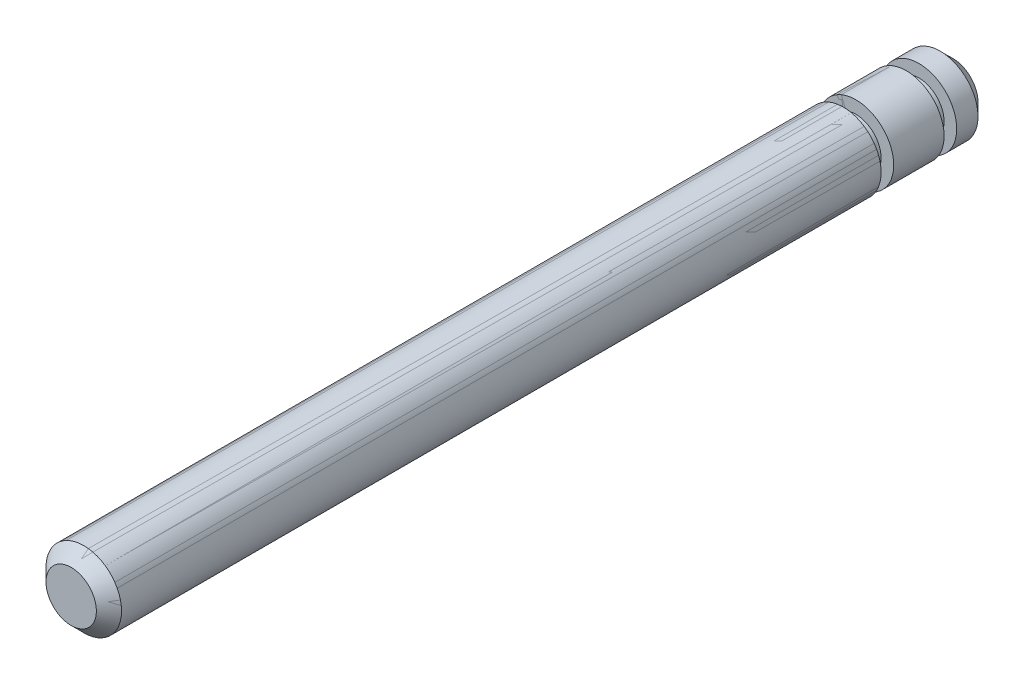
ISO-10303-21;
HEADER;
FILE_DESCRIPTION(('STEP AP214'),'2;1');
FILE_NAME('part.step','',(''),(''),'','','');
FILE_SCHEMA(('AUTOMOTIVE_DESIGN { 1 0 10303 214 1 1 1 1 }'));
ENDSEC;
DATA;
#1=APPLICATION_CONTEXT('core data for automotive mechanical design processes');
#2=APPLICATION_PROTOCOL_DEFINITION('international standard','automotive_design',2000,#1);
#3=PRODUCT_CONTEXT('',#1,'mechanical');
#4=PRODUCT('Part','Part','',(#3));
#5=PRODUCT_RELATED_PRODUCT_CATEGORY('part','',(#4));
#6=PRODUCT_DEFINITION_FORMATION('','',#4);
#7=PRODUCT_DEFINITION_CONTEXT('part definition',#1,'design');
#8=PRODUCT_DEFINITION('design','',#6,#7);
#9=PRODUCT_DEFINITION_SHAPE('','',#8);
#10=(LENGTH_UNIT() NAMED_UNIT(*) SI_UNIT(.MILLI.,.METRE.));
#11=(NAMED_UNIT(*) PLANE_ANGLE_UNIT() SI_UNIT($,.RADIAN.));
#12=(NAMED_UNIT(*) SI_UNIT($,.STERADIAN.) SOLID_ANGLE_UNIT());
#13=UNCERTAINTY_MEASURE_WITH_UNIT(LENGTH_MEASURE(1.E-05),#10,'distance_accuracy_value','');
#14=(GEOMETRIC_REPRESENTATION_CONTEXT(3) GLOBAL_UNCERTAINTY_ASSIGNED_CONTEXT((#13)) GLOBAL_UNIT_ASSIGNED_CONTEXT((#10,
#11,#12)) REPRESENTATION_CONTEXT('',''));
#15=CARTESIAN_POINT('',(0.,0.,0.));
#16=DIRECTION('',(0.,0.,1.));
#17=DIRECTION('',(1.,0.,0.));
#18=AXIS2_PLACEMENT_3D('',#15,#16,#17);
#19=CARTESIAN_POINT('',(1.,-1.,-35.));
#20=DIRECTION('',(0.,0.,-1.));
#21=DIRECTION('',(-1.,0.,0.));
#22=AXIS2_PLACEMENT_3D('',#19,#20,#21);
#23=PLANE('',#22);
#24=CARTESIAN_POINT('',(0.,0.,-35.));
#25=DIRECTION('',(0.,0.,1.));
#26=DIRECTION('',(1.,0.,0.));
#27=AXIS2_PLACEMENT_3D('',#24,#25,#26);
#28=CIRCLE('',#27,1.);
#29=CARTESIAN_POINT('',(1.,0.,-35.));
#30=VERTEX_POINT('',#29);
#31=EDGE_CURVE('P0_E405',#30,#30,#28,.F.);
#32=ORIENTED_EDGE('',*,*,#31,.T.);
#33=EDGE_LOOP('',(#32));
#34=FACE_BOUND('',#33,.T.);
#35=ADVANCED_FACE('P0_F348',(#34),#23,.T.);
#36=CARTESIAN_POINT('',(0.,0.,-35.));
#37=DIRECTION('',(0.,0.,1.));
#38=DIRECTION('',(1.,0.,0.));
#39=AXIS2_PLACEMENT_3D('',#36,#37,#38);
#40=CONICAL_SURFACE('',#39,1.,0.785398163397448);
#41=ORIENTED_EDGE('',*,*,#31,.F.);
#42=EDGE_LOOP('',(#41));
#43=FACE_BOUND('',#42,.T.);
#44=CARTESIAN_POINT('',(0.,0.,-34.5));
#45=DIRECTION('',(0.,0.,1.));
#46=DIRECTION('',(0.,-1.,0.));
#47=AXIS2_PLACEMENT_3D('',#44,#45,#46);
#48=CIRCLE('',#47,1.5);
#49=CARTESIAN_POINT('',(0.,-1.5,-34.5));
#50=VERTEX_POINT('',#49);
#51=EDGE_CURVE('P0_E403',#50,#50,#48,.F.);
#52=ORIENTED_EDGE('',*,*,#51,.T.);
#53=EDGE_LOOP('',(#52));
#54=FACE_BOUND('',#53,.T.);
#55=ADVANCED_FACE('P0_F415',(#43,#54),#40,.T.);
#56=CARTESIAN_POINT('',(0.,0.,-34.5));
#57=DIRECTION('',(0.,0.,1.));
#58=DIRECTION('',(1.,0.,0.));
#59=AXIS2_PLACEMENT_3D('',#56,#57,#58);
#60=CYLINDRICAL_SURFACE('',#59,1.5);
#61=ORIENTED_EDGE('',*,*,#51,.F.);
#62=EDGE_LOOP('',(#61));
#63=FACE_BOUND('',#62,.T.);
#64=CARTESIAN_POINT('',(0.,0.,-33.6540605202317));
#65=DIRECTION('',(0.,0.,1.));
#66=DIRECTION('',(1.,0.,0.));
#67=AXIS2_PLACEMENT_3D('',#64,#65,#66);
#68=CIRCLE('',#67,1.5);
#69=CARTESIAN_POINT('',(1.5,0.,-33.6540605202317));
#70=VERTEX_POINT('',#69);
#71=EDGE_CURVE('P0_E398',#70,#70,#68,.F.);
#72=ORIENTED_EDGE('',*,*,#71,.T.);
#73=EDGE_LOOP('',(#72));
#74=FACE_BOUND('',#73,.T.);
#75=ADVANCED_FACE('P0_F417',(#63,#74),#60,.T.);
#76=CARTESIAN_POINT('',(0.463525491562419,-2.92658477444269,-33.654060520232));
#77=DIRECTION('',(0.,0.,-1.));
#78=DIRECTION('',(-0.809016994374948,0.587785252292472,0.));
#79=AXIS2_PLACEMENT_3D('',#76,#77,#78);
#80=PLANE('',#79);
#81=CARTESIAN_POINT('',(0.,0.,-33.654060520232));
#82=DIRECTION('',(0.,0.,1.));
#83=DIRECTION('',(1.,0.,0.));
#84=AXIS2_PLACEMENT_3D('',#81,#82,#83);
#85=CIRCLE('',#84,1.);
#86=CARTESIAN_POINT('',(1.,0.,-33.654060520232));
#87=VERTEX_POINT('',#86);
#88=EDGE_CURVE('P0_E393',#87,#87,#85,.F.);
#89=ORIENTED_EDGE('',*,*,#88,.T.);
#90=EDGE_LOOP('',(#89));
#91=FACE_BOUND('',#90,.T.);
#92=ORIENTED_EDGE('',*,*,#71,.F.);
#93=EDGE_LOOP('',(#92));
#94=FACE_BOUND('',#93,.T.);
#95=ADVANCED_FACE('P0_F420',(#91,#94),#80,.F.);
#96=CARTESIAN_POINT('',(0.,0.,-33.654060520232));
#97=DIRECTION('',(0.,0.,1.));
#98=DIRECTION('',(1.,0.,0.));
#99=AXIS2_PLACEMENT_3D('',#96,#97,#98);
#100=CYLINDRICAL_SURFACE('',#99,1.);
#101=ORIENTED_EDGE('',*,*,#88,.F.);
#102=EDGE_LOOP('',(#101));
#103=FACE_BOUND('',#102,.T.);
#104=CARTESIAN_POINT('',(0.,0.,-33.154060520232));
#105=DIRECTION('',(0.,0.,1.));
#106=DIRECTION('',(1.,0.,0.));
#107=AXIS2_PLACEMENT_3D('',#104,#105,#106);
#108=CIRCLE('',#107,1.);
#109=CARTESIAN_POINT('',(1.,0.,-33.154060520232));
#110=VERTEX_POINT('',#109);
#111=EDGE_CURVE('P0_E388',#110,#110,#108,.F.);
#112=ORIENTED_EDGE('',*,*,#111,.T.);
#113=EDGE_LOOP('',(#112));
#114=FACE_BOUND('',#113,.T.);
#115=ADVANCED_FACE('P0_F425',(#103,#114),#100,.T.);
#116=CARTESIAN_POINT('',(2.92658477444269,0.463525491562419,-33.154060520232));
#117=DIRECTION('',(0.,0.,1.));
#118=DIRECTION('',(-0.809016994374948,0.587785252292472,0.));
#119=AXIS2_PLACEMENT_3D('',#116,#117,#118);
#120=PLANE('',#119);
#121=ORIENTED_EDGE('',*,*,#111,.F.);
#122=EDGE_LOOP('',(#121));
#123=FACE_BOUND('',#122,.T.);
#124=CARTESIAN_POINT('',(0.,0.,-33.1540605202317));
#125=DIRECTION('',(0.,0.,1.));
#126=DIRECTION('',(1.,0.,0.));
#127=AXIS2_PLACEMENT_3D('',#124,#125,#126);
#128=CIRCLE('',#127,1.5);
#129=CARTESIAN_POINT('',(1.5,0.,-33.1540605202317));
#130=VERTEX_POINT('',#129);
#131=EDGE_CURVE('P0_E383',#130,#130,#128,.F.);
#132=ORIENTED_EDGE('',*,*,#131,.T.);
#133=EDGE_LOOP('',(#132));
#134=FACE_BOUND('',#133,.T.);
#135=ADVANCED_FACE('P0_F431',(#123,#134),#120,.F.);
#136=CARTESIAN_POINT('',(0.,0.,-33.1540605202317));
#137=DIRECTION('',(0.,0.,1.));
#138=DIRECTION('',(1.,0.,0.));
#139=AXIS2_PLACEMENT_3D('',#136,#137,#138);
#140=CYLINDRICAL_SURFACE('',#139,1.5);
#141=ORIENTED_EDGE('',*,*,#131,.F.);
#142=EDGE_LOOP('',(#141));
#143=FACE_BOUND('',#142,.T.);
#144=CARTESIAN_POINT('',(0.,0.,-31.1540605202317));
#145=DIRECTION('',(0.,0.,1.));
#146=DIRECTION('',(1.,0.,0.));
#147=AXIS2_PLACEMENT_3D('',#144,#145,#146);
#148=CIRCLE('',#147,1.5);
#149=CARTESIAN_POINT('',(1.5,0.,-31.1540605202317));
#150=VERTEX_POINT('',#149);
#151=EDGE_CURVE('P0_E378',#150,#150,#148,.F.);
#152=ORIENTED_EDGE('',*,*,#151,.T.);
#153=EDGE_LOOP('',(#152));
#154=FACE_BOUND('',#153,.T.);
#155=ADVANCED_FACE('P0_F462',(#143,#154),#140,.T.);
#156=CARTESIAN_POINT('',(0.463525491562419,-2.92658477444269,-31.154060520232));
#157=DIRECTION('',(0.,0.,-1.));
#158=DIRECTION('',(-0.809016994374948,0.587785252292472,0.));
#159=AXIS2_PLACEMENT_3D('',#156,#157,#158);
#160=PLANE('',#159);
#161=CARTESIAN_POINT('',(0.,0.,-31.154060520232));
#162=DIRECTION('',(0.,0.,1.));
#163=DIRECTION('',(1.,0.,0.));
#164=AXIS2_PLACEMENT_3D('',#161,#162,#163);
#165=CIRCLE('',#164,1.);
#166=CARTESIAN_POINT('',(1.,0.,-31.154060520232));
#167=VERTEX_POINT('',#166);
#168=EDGE_CURVE('P0_E373',#167,#167,#165,.F.);
#169=ORIENTED_EDGE('',*,*,#168,.T.);
#170=EDGE_LOOP('',(#169));
#171=FACE_BOUND('',#170,.T.);
#172=ORIENTED_EDGE('',*,*,#151,.F.);
#173=EDGE_LOOP('',(#172));
#174=FACE_BOUND('',#173,.T.);
#175=ADVANCED_FACE('P0_F464',(#171,#174),#160,.F.);
#176=CARTESIAN_POINT('',(0.,0.,-31.154060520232));
#177=DIRECTION('',(0.,0.,1.));
#178=DIRECTION('',(1.,0.,0.));
#179=AXIS2_PLACEMENT_3D('',#176,#177,#178);
#180=CYLINDRICAL_SURFACE('',#179,1.);
#181=ORIENTED_EDGE('',*,*,#168,.F.);
#182=EDGE_LOOP('',(#181));
#183=FACE_BOUND('',#182,.T.);
#184=CARTESIAN_POINT('',(0.,0.,-30.654060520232));
#185=DIRECTION('',(0.,0.,1.));
#186=DIRECTION('',(1.,0.,0.));
#187=AXIS2_PLACEMENT_3D('',#184,#185,#186);
#188=CIRCLE('',#187,1.);
#189=CARTESIAN_POINT('',(1.,0.,-30.654060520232));
#190=VERTEX_POINT('',#189);
#191=EDGE_CURVE('P0_E368',#190,#190,#188,.F.);
#192=ORIENTED_EDGE('',*,*,#191,.T.);
#193=EDGE_LOOP('',(#192));
#194=FACE_BOUND('',#193,.T.);
#195=ADVANCED_FACE('P0_F466',(#183,#194),#180,.T.);
#196=CARTESIAN_POINT('',(2.92658477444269,0.463525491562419,-30.654060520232));
#197=DIRECTION('',(0.,0.,1.));
#198=DIRECTION('',(-0.809016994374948,0.587785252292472,0.));
#199=AXIS2_PLACEMENT_3D('',#196,#197,#198);
#200=PLANE('',#199);
#201=ORIENTED_EDGE('',*,*,#191,.F.);
#202=EDGE_LOOP('',(#201));
#203=FACE_BOUND('',#202,.T.);
#204=CARTESIAN_POINT('',(0.,0.,-30.6540605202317));
#205=DIRECTION('',(0.,0.,1.));
#206=DIRECTION('',(1.,0.,0.));
#207=AXIS2_PLACEMENT_3D('',#204,#205,#206);
#208=CIRCLE('',#207,1.5);
#209=CARTESIAN_POINT('',(1.5,0.,-30.6540605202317));
#210=VERTEX_POINT('',#209);
#211=EDGE_CURVE('P0_E361',#210,#210,#208,.F.);
#212=ORIENTED_EDGE('',*,*,#211,.T.);
#213=EDGE_LOOP('',(#212));
#214=FACE_BOUND('',#213,.T.);
#215=ADVANCED_FACE('P0_F447',(#203,#214),#200,.F.);
#216=CARTESIAN_POINT('',(0.,0.,-30.6540605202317));
#217=DIRECTION('',(0.,0.,1.));
#218=DIRECTION('',(1.,0.,0.));
#219=AXIS2_PLACEMENT_3D('',#216,#217,#218);
#220=CYLINDRICAL_SURFACE('',#219,1.5);
#221=ORIENTED_EDGE('',*,*,#211,.F.);
#222=EDGE_LOOP('',(#221));
#223=FACE_BOUND('',#222,.T.);
#224=CARTESIAN_POINT('',(0.,0.,-0.5));
#225=DIRECTION('',(0.,0.,1.));
#226=DIRECTION('',(0.,-1.,0.));
#227=AXIS2_PLACEMENT_3D('',#224,#225,#226);
#228=CIRCLE('',#227,1.5);
#229=CARTESIAN_POINT('',(0.,-1.5,-0.5));
#230=VERTEX_POINT('',#229);
#231=EDGE_CURVE('P0_E356',#230,#230,#228,.F.);
#232=ORIENTED_EDGE('',*,*,#231,.T.);
#233=EDGE_LOOP('',(#232));
#234=FACE_BOUND('',#233,.T.);
#235=ADVANCED_FACE('P0_F441',(#223,#234),#220,.T.);
#236=CARTESIAN_POINT('',(0.,0.,-0.5));
#237=DIRECTION('',(0.,0.,-1.));
#238=DIRECTION('',(-1.,0.,0.));
#239=AXIS2_PLACEMENT_3D('',#236,#237,#238);
#240=CONICAL_SURFACE('',#239,1.5,0.785398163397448);
#241=ORIENTED_EDGE('',*,*,#231,.F.);
#242=EDGE_LOOP('',(#241));
#243=FACE_BOUND('',#242,.T.);
#244=CARTESIAN_POINT('',(0.,0.,0.));
#245=DIRECTION('',(0.,0.,-1.));
#246=DIRECTION('',(-1.,0.,0.));
#247=AXIS2_PLACEMENT_3D('',#244,#245,#246);
#248=CIRCLE('',#247,1.);
#249=CARTESIAN_POINT('',(-1.,0.,0.));
#250=VERTEX_POINT('',#249);
#251=EDGE_CURVE('P0_E10',#250,#250,#248,.F.);
#252=ORIENTED_EDGE('',*,*,#251,.F.);
#253=EDGE_LOOP('',(#252));
#254=FACE_BOUND('',#253,.T.);
#255=ADVANCED_FACE('P0_F437',(#243,#254),#240,.T.);
#256=CARTESIAN_POINT('',(-1.63185168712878,-1.,0.));
#257=DIRECTION('',(0.,0.,1.));
#258=DIRECTION('',(1.,0.,0.));
#259=AXIS2_PLACEMENT_3D('',#256,#257,#258);
#260=PLANE('',#259);
#261=ORIENTED_EDGE('',*,*,#251,.T.);
#262=EDGE_LOOP('',(#261));
#263=FACE_BOUND('',#262,.T.);
#264=ADVANCED_FACE('P0_F350',(#263),#260,.T.);
#265=CLOSED_SHELL('',(#35,#55,#75,#95,#115,#135,#155,#175,#195,#215,#235,#255,#264));
#266=MANIFOLD_SOLID_BREP('P0_B2',#265);
#267=CARTESIAN_POINT('',(1.,-1.,-35.));
#268=DIRECTION('',(0.,0.,-1.));
#269=DIRECTION('',(-1.,0.,0.));
#270=AXIS2_PLACEMENT_3D('',#267,#268,#269);
#271=PLANE('',#270);
#272=CARTESIAN_POINT('',(0.,0.,-35.));
#273=DIRECTION('',(0.,0.,1.));
#274=DIRECTION('',(1.,0.,0.));
#275=AXIS2_PLACEMENT_3D('',#272,#273,#274);
#276=CIRCLE('',#275,1.);
#277=CARTESIAN_POINT('',(1.,0.,-35.));
#278=VERTEX_POINT('',#277);
#279=EDGE_CURVE('P1_E71',#278,#278,#276,.F.);
#280=ORIENTED_EDGE('',*,*,#279,.T.);
#281=EDGE_LOOP('',(#280));
#282=FACE_BOUND('',#281,.T.);
#283=ADVANCED_FACE('P1_F14',(#282),#271,.T.);
#284=CARTESIAN_POINT('',(0.,0.,-35.));
#285=DIRECTION('',(0.,0.,1.));
#286=DIRECTION('',(1.,0.,0.));
#287=AXIS2_PLACEMENT_3D('',#284,#285,#286);
#288=CONICAL_SURFACE('',#287,1.,0.785398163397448);
#289=ORIENTED_EDGE('',*,*,#279,.F.);
#290=EDGE_LOOP('',(#289));
#291=FACE_BOUND('',#290,.T.);
#292=CARTESIAN_POINT('',(0.,0.,-34.5));
#293=DIRECTION('',(0.,0.,1.));
#294=DIRECTION('',(0.,-1.,0.));
#295=AXIS2_PLACEMENT_3D('',#292,#293,#294);
#296=CIRCLE('',#295,1.5);
#297=CARTESIAN_POINT('',(0.,-1.5,-34.5));
#298=VERTEX_POINT('',#297);
#299=EDGE_CURVE('P1_E69',#298,#298,#296,.F.);
#300=ORIENTED_EDGE('',*,*,#299,.T.);
#301=EDGE_LOOP('',(#300));
#302=FACE_BOUND('',#301,.T.);
#303=ADVANCED_FACE('P1_F81',(#291,#302),#288,.T.);
#304=CARTESIAN_POINT('',(0.,0.,-34.5));
#305=DIRECTION('',(0.,0.,1.));
#306=DIRECTION('',(1.,0.,0.));
#307=AXIS2_PLACEMENT_3D('',#304,#305,#306);
#308=CYLINDRICAL_SURFACE('',#307,1.5);
#309=ORIENTED_EDGE('',*,*,#299,.F.);
#310=EDGE_LOOP('',(#309));
#311=FACE_BOUND('',#310,.T.);
#312=CARTESIAN_POINT('',(0.,0.,-33.6540605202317));
#313=DIRECTION('',(0.,0.,1.));
#314=DIRECTION('',(1.,0.,0.));
#315=AXIS2_PLACEMENT_3D('',#312,#313,#314);
#316=CIRCLE('',#315,1.5);
#317=CARTESIAN_POINT('',(1.5,0.,-33.6540605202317));
#318=VERTEX_POINT('',#317);
#319=EDGE_CURVE('P1_E64',#318,#318,#316,.F.);
#320=ORIENTED_EDGE('',*,*,#319,.T.);
#321=EDGE_LOOP('',(#320));
#322=FACE_BOUND('',#321,.T.);
#323=ADVANCED_FACE('P1_F83',(#311,#322),#308,.T.);
#324=CARTESIAN_POINT('',(0.463525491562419,-2.92658477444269,-33.654060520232));
#325=DIRECTION('',(0.,0.,-1.));
#326=DIRECTION('',(-0.809016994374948,0.587785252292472,0.));
#327=AXIS2_PLACEMENT_3D('',#324,#325,#326);
#328=PLANE('',#327);
#329=CARTESIAN_POINT('',(0.,0.,-33.654060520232));
#330=DIRECTION('',(0.,0.,1.));
#331=DIRECTION('',(1.,0.,0.));
#332=AXIS2_PLACEMENT_3D('',#329,#330,#331);
#333=CIRCLE('',#332,1.);
#334=CARTESIAN_POINT('',(1.,0.,-33.654060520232));
#335=VERTEX_POINT('',#334);
#336=EDGE_CURVE('P1_E59',#335,#335,#333,.F.);
#337=ORIENTED_EDGE('',*,*,#336,.T.);
#338=EDGE_LOOP('',(#337));
#339=FACE_BOUND('',#338,.T.);
#340=ORIENTED_EDGE('',*,*,#319,.F.);
#341=EDGE_LOOP('',(#340));
#342=FACE_BOUND('',#341,.T.);
#343=ADVANCED_FACE('P1_F85',(#339,#342),#328,.F.);
#344=CARTESIAN_POINT('',(0.,0.,-33.654060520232));
#345=DIRECTION('',(0.,0.,1.));
#346=DIRECTION('',(1.,0.,0.));
#347=AXIS2_PLACEMENT_3D('',#344,#345,#346);
#348=CYLINDRICAL_SURFACE('',#347,1.);
#349=ORIENTED_EDGE('',*,*,#336,.F.);
#350=EDGE_LOOP('',(#349));
#351=FACE_BOUND('',#350,.T.);
#352=CARTESIAN_POINT('',(0.,0.,-33.154060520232));
#353=DIRECTION('',(0.,0.,1.));
#354=DIRECTION('',(1.,0.,0.));
#355=AXIS2_PLACEMENT_3D('',#352,#353,#354);
#356=CIRCLE('',#355,1.);
#357=CARTESIAN_POINT('',(1.,0.,-33.154060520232));
#358=VERTEX_POINT('',#357);
#359=EDGE_CURVE('P1_E54',#358,#358,#356,.F.);
#360=ORIENTED_EDGE('',*,*,#359,.T.);
#361=EDGE_LOOP('',(#360));
#362=FACE_BOUND('',#361,.T.);
#363=ADVANCED_FACE('P1_F89',(#351,#362),#348,.T.);
#364=CARTESIAN_POINT('',(2.92658477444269,0.463525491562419,-33.154060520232));
#365=DIRECTION('',(0.,0.,1.));
#366=DIRECTION('',(-0.809016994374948,0.587785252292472,0.));
#367=AXIS2_PLACEMENT_3D('',#364,#365,#366);
#368=PLANE('',#367);
#369=ORIENTED_EDGE('',*,*,#359,.F.);
#370=EDGE_LOOP('',(#369));
#371=FACE_BOUND('',#370,.T.);
#372=CARTESIAN_POINT('',(0.,0.,-33.1540605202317));
#373=DIRECTION('',(0.,0.,1.));
#374=DIRECTION('',(1.,0.,0.));
#375=AXIS2_PLACEMENT_3D('',#372,#373,#374);
#376=CIRCLE('',#375,1.5);
#377=CARTESIAN_POINT('',(1.5,0.,-33.1540605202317));
#378=VERTEX_POINT('',#377);
#379=EDGE_CURVE('P1_E49',#378,#378,#376,.F.);
#380=ORIENTED_EDGE('',*,*,#379,.T.);
#381=EDGE_LOOP('',(#380));
#382=FACE_BOUND('',#381,.T.);
#383=ADVANCED_FACE('P1_F92',(#371,#382),#368,.F.);
#384=CARTESIAN_POINT('',(0.,0.,-33.1540605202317));
#385=DIRECTION('',(0.,0.,1.));
#386=DIRECTION('',(1.,0.,0.));
#387=AXIS2_PLACEMENT_3D('',#384,#385,#386);
#388=CYLINDRICAL_SURFACE('',#387,1.5);
#389=ORIENTED_EDGE('',*,*,#379,.F.);
#390=EDGE_LOOP('',(#389));
#391=FACE_BOUND('',#390,.T.);
#392=CARTESIAN_POINT('',(0.,0.,-31.1540605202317));
#393=DIRECTION('',(0.,0.,1.));
#394=DIRECTION('',(1.,0.,0.));
#395=AXIS2_PLACEMENT_3D('',#392,#393,#394);
#396=CIRCLE('',#395,1.5);
#397=CARTESIAN_POINT('',(1.5,0.,-31.1540605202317));
#398=VERTEX_POINT('',#397);
#399=EDGE_CURVE('P1_E44',#398,#398,#396,.F.);
#400=ORIENTED_EDGE('',*,*,#399,.T.);
#401=EDGE_LOOP('',(#400));
#402=FACE_BOUND('',#401,.T.);
#403=ADVANCED_FACE('P1_F110',(#391,#402),#388,.T.);
#404=CARTESIAN_POINT('',(0.463525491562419,-2.92658477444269,-31.154060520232));
#405=DIRECTION('',(0.,0.,-1.));
#406=DIRECTION('',(-0.809016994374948,0.587785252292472,0.));
#407=AXIS2_PLACEMENT_3D('',#404,#405,#406);
#408=PLANE('',#407);
#409=CARTESIAN_POINT('',(0.,0.,-31.154060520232));
#410=DIRECTION('',(0.,0.,1.));
#411=DIRECTION('',(1.,0.,0.));
#412=AXIS2_PLACEMENT_3D('',#409,#410,#411);
#413=CIRCLE('',#412,1.);
#414=CARTESIAN_POINT('',(1.,0.,-31.154060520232));
#415=VERTEX_POINT('',#414);
#416=EDGE_CURVE('P1_E39',#415,#415,#413,.F.);
#417=ORIENTED_EDGE('',*,*,#416,.T.);
#418=EDGE_LOOP('',(#417));
#419=FACE_BOUND('',#418,.T.);
#420=ORIENTED_EDGE('',*,*,#399,.F.);
#421=EDGE_LOOP('',(#420));
#422=FACE_BOUND('',#421,.T.);
#423=ADVANCED_FACE('P1_F111',(#419,#422),#408,.F.);
#424=CARTESIAN_POINT('',(0.,0.,-31.154060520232));
#425=DIRECTION('',(0.,0.,1.));
#426=DIRECTION('',(1.,0.,0.));
#427=AXIS2_PLACEMENT_3D('',#424,#425,#426);
#428=CYLINDRICAL_SURFACE('',#427,1.);
#429=ORIENTED_EDGE('',*,*,#416,.F.);
#430=EDGE_LOOP('',(#429));
#431=FACE_BOUND('',#430,.T.);
#432=CARTESIAN_POINT('',(0.,0.,-30.654060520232));
#433=DIRECTION('',(0.,0.,1.));
#434=DIRECTION('',(1.,0.,0.));
#435=AXIS2_PLACEMENT_3D('',#432,#433,#434);
#436=CIRCLE('',#435,1.);
#437=CARTESIAN_POINT('',(1.,0.,-30.654060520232));
#438=VERTEX_POINT('',#437);
#439=EDGE_CURVE('P1_E34',#438,#438,#436,.F.);
#440=ORIENTED_EDGE('',*,*,#439,.T.);
#441=EDGE_LOOP('',(#440));
#442=FACE_BOUND('',#441,.T.);
#443=ADVANCED_FACE('P1_F113',(#431,#442),#428,.T.);
#444=CARTESIAN_POINT('',(2.92658477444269,0.463525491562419,-30.654060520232));
#445=DIRECTION('',(0.,0.,1.));
#446=DIRECTION('',(-0.809016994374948,0.587785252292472,0.));
#447=AXIS2_PLACEMENT_3D('',#444,#445,#446);
#448=PLANE('',#447);
#449=ORIENTED_EDGE('',*,*,#439,.F.);
#450=EDGE_LOOP('',(#449));
#451=FACE_BOUND('',#450,.T.);
#452=CARTESIAN_POINT('',(0.,0.,-30.6540605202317));
#453=DIRECTION('',(0.,0.,1.));
#454=DIRECTION('',(1.,0.,0.));
#455=AXIS2_PLACEMENT_3D('',#452,#453,#454);
#456=CIRCLE('',#455,1.5);
#457=CARTESIAN_POINT('',(1.5,0.,-30.6540605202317));
#458=VERTEX_POINT('',#457);
#459=EDGE_CURVE('P1_E27',#458,#458,#456,.F.);
#460=ORIENTED_EDGE('',*,*,#459,.T.);
#461=EDGE_LOOP('',(#460));
#462=FACE_BOUND('',#461,.T.);
#463=ADVANCED_FACE('P1_F101',(#451,#462),#448,.F.);
#464=CARTESIAN_POINT('',(0.,0.,-30.6540605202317));
#465=DIRECTION('',(0.,0.,1.));
#466=DIRECTION('',(1.,0.,0.));
#467=AXIS2_PLACEMENT_3D('',#464,#465,#466);
#468=CYLINDRICAL_SURFACE('',#467,1.5);
#469=ORIENTED_EDGE('',*,*,#459,.F.);
#470=EDGE_LOOP('',(#469));
#471=FACE_BOUND('',#470,.T.);
#472=CARTESIAN_POINT('',(0.,0.,-0.5));
#473=DIRECTION('',(0.,0.,1.));
#474=DIRECTION('',(0.,-1.,0.));
#475=AXIS2_PLACEMENT_3D('',#472,#473,#474);
#476=CIRCLE('',#475,1.5);
#477=CARTESIAN_POINT('',(0.,-1.5,-0.5));
#478=VERTEX_POINT('',#477);
#479=EDGE_CURVE('P1_E22',#478,#478,#476,.F.);
#480=ORIENTED_EDGE('',*,*,#479,.T.);
#481=EDGE_LOOP('',(#480));
#482=FACE_BOUND('',#481,.T.);
#483=ADVANCED_FACE('P1_F98',(#471,#482),#468,.T.);
#484=CARTESIAN_POINT('',(0.,0.,-0.5));
#485=DIRECTION('',(0.,0.,-1.));
#486=DIRECTION('',(-1.,0.,0.));
#487=AXIS2_PLACEMENT_3D('',#484,#485,#486);
#488=CONICAL_SURFACE('',#487,1.5,0.785398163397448);
#489=ORIENTED_EDGE('',*,*,#479,.F.);
#490=EDGE_LOOP('',(#489));
#491=FACE_BOUND('',#490,.T.);
#492=CARTESIAN_POINT('',(0.,0.,0.));
#493=DIRECTION('',(0.,0.,-1.));
#494=DIRECTION('',(-1.,0.,0.));
#495=AXIS2_PLACEMENT_3D('',#492,#493,#494);
#496=CIRCLE('',#495,1.);
#497=CARTESIAN_POINT('',(-1.,0.,0.));
#498=VERTEX_POINT('',#497);
#499=EDGE_CURVE('P1_E9',#498,#498,#496,.F.);
#500=ORIENTED_EDGE('',*,*,#499,.F.);
#501=EDGE_LOOP('',(#500));
#502=FACE_BOUND('',#501,.T.);
#503=ADVANCED_FACE('P1_F97',(#491,#502),#488,.T.);
#504=CARTESIAN_POINT('',(-1.63185168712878,-1.,0.));
#505=DIRECTION('',(0.,0.,1.));
#506=DIRECTION('',(1.,0.,0.));
#507=AXIS2_PLACEMENT_3D('',#504,#505,#506);
#508=PLANE('',#507);
#509=ORIENTED_EDGE('',*,*,#499,.T.);
#510=EDGE_LOOP('',(#509));
#511=FACE_BOUND('',#510,.T.);
#512=ADVANCED_FACE('P1_F16',(#511),#508,.T.);
#513=CLOSED_SHELL('',(#283,#303,#323,#343,#363,#383,#403,#423,#443,#463,#483,#503,#512));
#514=MANIFOLD_SOLID_BREP('P1_B1',#513);
#515=ADVANCED_BREP_SHAPE_REPRESENTATION('',(#18,#266,#514),#14);
#516=SHAPE_DEFINITION_REPRESENTATION(#9,#515);
ENDSEC;
END-ISO-10303-21;
